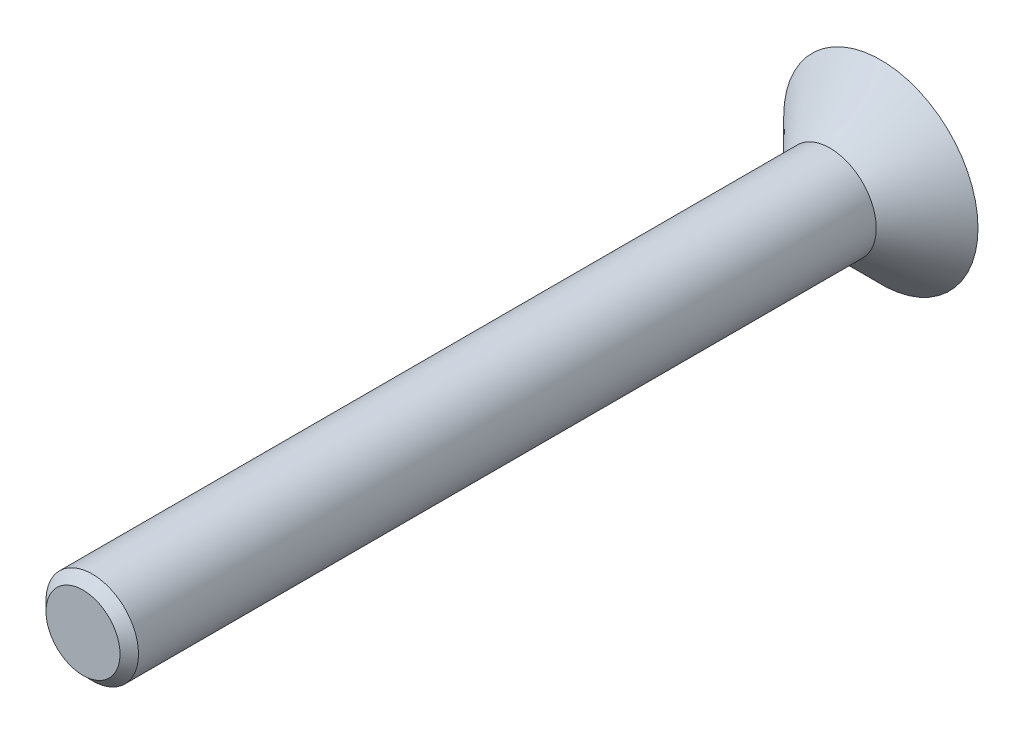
from build123d import *

# Parameters (mm, degrees)
FENTE1_DEPTH    = 2
ESQUISSE3_W     = 2
ESQUISSE3_H     = 32.3
CHANFREIN1_SIZE = 0.4


with BuildPart() as part:
    # Esquisse1 → Base-R_volution (revolve)
    with BuildSketch(Plane(origin=(0, 0, 0), x_dir=(1, 0, 0), z_dir=(0, 1, 0)), mode=Mode.PRIVATE) as base_r_volution_sk:
        Polygon((2, 0), (4.2, 2.2), (0, 2.2), (0, 0), align=None)
    revolve(base_r_volution_sk.sketch.rotate(Axis((0, 0, 0), (0, 0, -1)), 180), axis=Axis((0, 0, 0), (0, 0, -1)))

    # Esquisse2 → fente1 (cut)
    with BuildSketch(Plane.XY.offset(-2.2)):
        Polygon((1.25, -0.721687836), (1.25, 0.721687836), (0, 1.443375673), (-1.25, 0.721687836), (-1.25, -0.721687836), (0, -1.443375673), align=None)
    extrude(amount=FENTE1_DEPTH, mode=Mode.SUBTRACT)

    # Esquisse3 → Boss.-R_vol.1 (revolve)
    with BuildSketch(Plane(origin=(0, 0, 0), x_dir=(1, 0, 0), z_dir=(0, 1, 0))):
        with Locations((1, -16.15)):
            Rectangle(ESQUISSE3_W, ESQUISSE3_H)
    revolve(axis=Axis((0, 0, 0), (0, 0, 1)))

    # Chanfrein1
    chanfrein1_edges = [part.edges().sort_by_distance(p)[0] for p in [
        (-2, 0, 32.3),
    ]]
    chamfer(chanfrein1_edges, length=CHANFREIN1_SIZE)


solid = part.part
